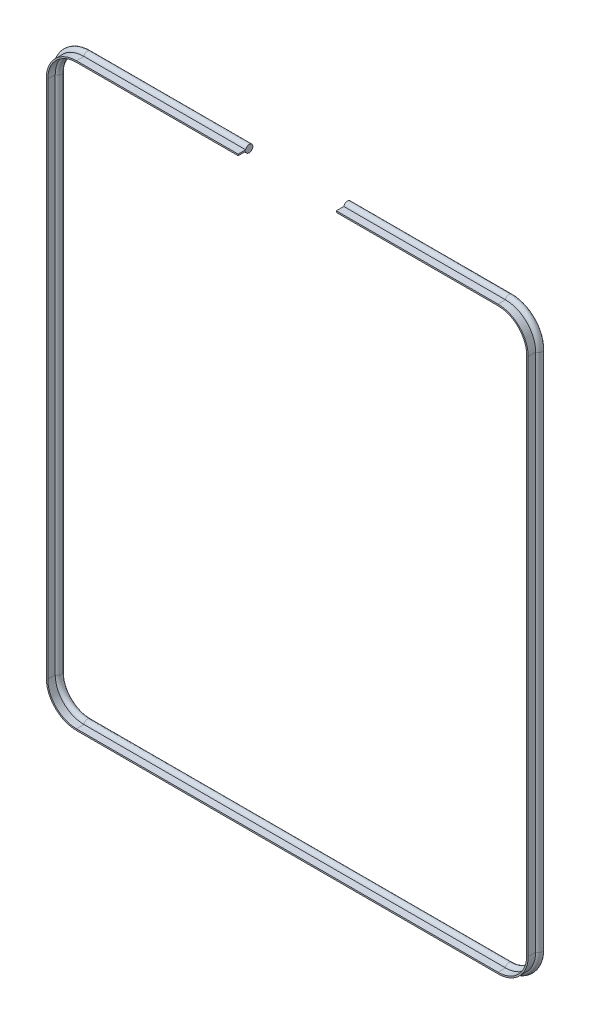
from build123d import *


with BuildPart() as part:
    # Austragung1: sweep along a path in Skizze3
    with BuildLine(Plane.XY.offset(7.5)) as austragung1_path:
        Line((-100, -10.5), (-429.5, -10.5))
        ThreePointArc((-429.5, -10.5), (-471.926406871, -28.073593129), (-489.5, -70.5))
        Line((-489.5, -70.5), (-489.5, -1129.5))
        ThreePointArc((-489.5, -1129.5), (-471.926406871, -1171.926406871), (-429.5, -1189.5))
        Line((-429.5, -1189.5), (429.5, -1189.5))
        ThreePointArc((429.5, -1189.5), (471.926406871, -1171.926406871), (489.5, -1129.5))
        Line((489.5, -1129.5), (489.5, -70.5))
        ThreePointArc((489.5, -70.5), (471.926406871, -28.073593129), (429.5, -10.5))
        Line((429.5, -10.5), (100, -10.5))
    # Skizze2 → Austragung1 (sweep)
    with BuildSketch(Plane(origin=(-100, 0, 0), x_dir=(0, 0, -1), z_dir=(1, 0, 0))):
        with BuildLine():
            Line((-30, -9), (-14.848469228, -9))
            ThreePointArc((-14.848469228, -9), (0, -10.5), (-14.848469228, -12))
            Line((-14.848469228, -12), (-30, -12))
            Line((-30, -12), (-30, -9))
        make_face()
    sweep(path=austragung1_path.line)


solid = part.part
